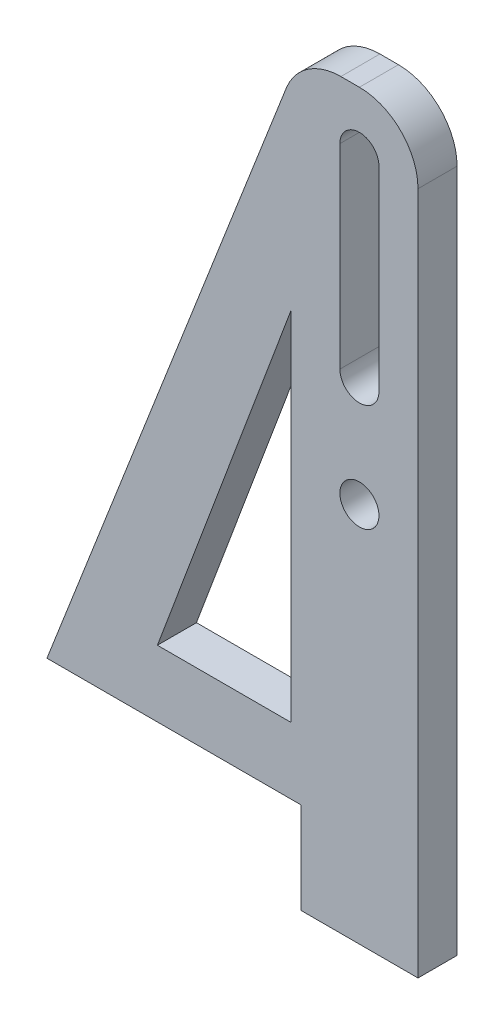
from build123d import *

# Parameters (mm, degrees)
ESQUISSE1_R        = 1
BOSS_EXTRU_1_DEPTH = 2
CONG_1_R           = 3


with BuildPart() as part:
    # Esquisse1 → Boss.-Extru.1 (new body)
    with BuildSketch(Plane.XY):
        Polygon((12, 16.201386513), (18, 16.201386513), (18, 54.201386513), (12, 54.201386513), (-1, 20.881685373), (12, 20.881685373), align=None)
        with Locations((15, 35.701386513)):
            Circle(ESQUISSE1_R, mode=Mode.SUBTRACT)
        with BuildLine():
            Line((16, 51.201386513), (16, 41.201386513))
            ThreePointArc((16, 41.201386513), (15, 40.201386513), (14, 41.201386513))
            Line((14, 41.201386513), (14, 51.201386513))
            ThreePointArc((14, 51.201386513), (15, 52.201386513), (16, 51.201386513))
        make_face(mode=Mode.SUBTRACT)
        Polygon((11.5, 42.554637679), (4.655788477, 24.28516686), (11.5, 24.28516686), align=None, mode=Mode.SUBTRACT)
    extrude(amount=BOSS_EXTRU_1_DEPTH)

    # Cong_1
    cong_1_edges = [part.edges().sort_by_distance(p)[0] for p in [
        (12, 54.201386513, 1),
        (18, 54.201386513, 1),
    ]]
    fillet(cong_1_edges, radius=CONG_1_R)


solid = part.part
